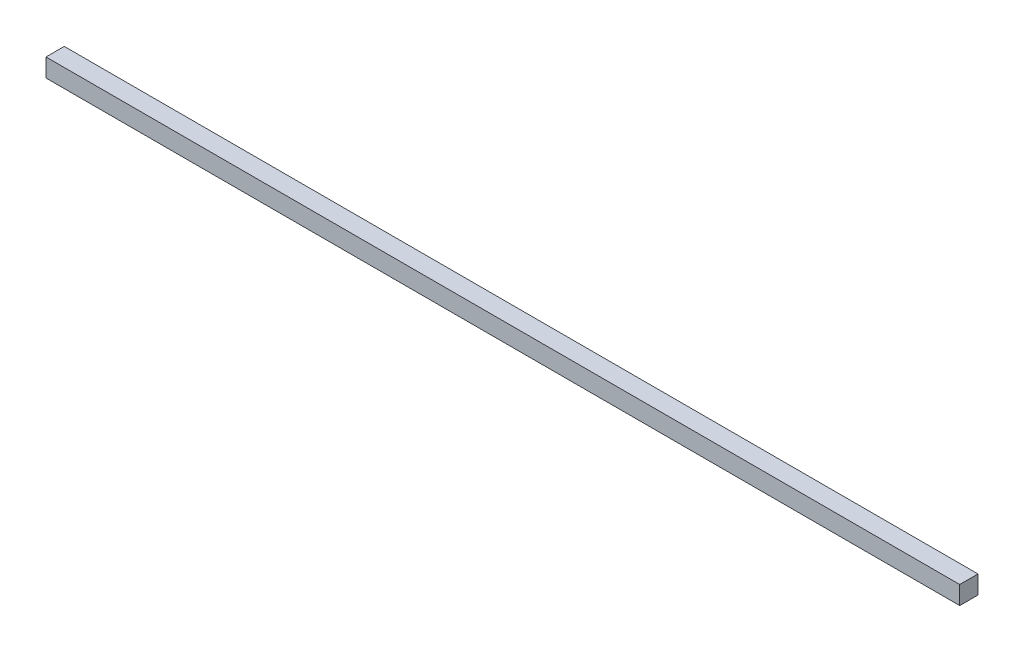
ISO-10303-21;
HEADER;
FILE_DESCRIPTION(('STEP AP214'),'2;1');
FILE_NAME('part.step','',(''),(''),'','','');
FILE_SCHEMA(('AUTOMOTIVE_DESIGN { 1 0 10303 214 1 1 1 1 }'));
ENDSEC;
DATA;
#1=APPLICATION_CONTEXT('core data for automotive mechanical design processes');
#2=APPLICATION_PROTOCOL_DEFINITION('international standard','automotive_design',2000,#1);
#3=PRODUCT_CONTEXT('',#1,'mechanical');
#4=PRODUCT('Part','Part','',(#3));
#5=PRODUCT_RELATED_PRODUCT_CATEGORY('part','',(#4));
#6=PRODUCT_DEFINITION_FORMATION('','',#4);
#7=PRODUCT_DEFINITION_CONTEXT('part definition',#1,'design');
#8=PRODUCT_DEFINITION('design','',#6,#7);
#9=PRODUCT_DEFINITION_SHAPE('','',#8);
#10=(LENGTH_UNIT() NAMED_UNIT(*) SI_UNIT(.MILLI.,.METRE.));
#11=(NAMED_UNIT(*) PLANE_ANGLE_UNIT() SI_UNIT($,.RADIAN.));
#12=(NAMED_UNIT(*) SI_UNIT($,.STERADIAN.) SOLID_ANGLE_UNIT());
#13=UNCERTAINTY_MEASURE_WITH_UNIT(LENGTH_MEASURE(1.E-05),#10,'distance_accuracy_value','');
#14=(GEOMETRIC_REPRESENTATION_CONTEXT(3) GLOBAL_UNCERTAINTY_ASSIGNED_CONTEXT((#13)) GLOBAL_UNIT_ASSIGNED_CONTEXT((#10,
#11,#12)) REPRESENTATION_CONTEXT('',''));
#15=CARTESIAN_POINT('',(0.,0.,0.));
#16=DIRECTION('',(0.,0.,1.));
#17=DIRECTION('',(1.,0.,0.));
#18=AXIS2_PLACEMENT_3D('',#15,#16,#17);
#19=CARTESIAN_POINT('',(500.,5.,5.));
#20=DIRECTION('',(0.,-1.,0.));
#21=DIRECTION('',(0.,0.,-1.));
#22=AXIS2_PLACEMENT_3D('',#19,#20,#21);
#23=PLANE('',#22);
#24=DIRECTION('',(0.,0.,1.));
#25=VECTOR('',#24,1.);
#26=CARTESIAN_POINT('',(0.,5.,5.));
#27=LINE('',#26,#25);
#28=CARTESIAN_POINT('',(0.,5.,-5.));
#29=VERTEX_POINT('',#28);
#30=CARTESIAN_POINT('',(0.,5.,5.));
#31=VERTEX_POINT('',#30);
#32=EDGE_CURVE('E106',#29,#31,#27,.T.);
#33=ORIENTED_EDGE('',*,*,#32,.T.);
#34=DIRECTION('',(-1.,0.,0.));
#35=VECTOR('',#34,1.);
#36=CARTESIAN_POINT('',(500.,5.,5.));
#37=LINE('',#36,#35);
#38=CARTESIAN_POINT('',(500.,5.,5.));
#39=VERTEX_POINT('',#38);
#40=EDGE_CURVE('E11',#39,#31,#37,.T.);
#41=ORIENTED_EDGE('',*,*,#40,.F.);
#42=DIRECTION('',(0.,0.,1.));
#43=VECTOR('',#42,1.);
#44=CARTESIAN_POINT('',(500.,5.,5.));
#45=LINE('',#44,#43);
#46=CARTESIAN_POINT('',(500.,5.,-5.));
#47=VERTEX_POINT('',#46);
#48=EDGE_CURVE('E94',#47,#39,#45,.T.);
#49=ORIENTED_EDGE('',*,*,#48,.F.);
#50=DIRECTION('',(-1.,0.,0.));
#51=VECTOR('',#50,1.);
#52=CARTESIAN_POINT('',(500.,5.,-5.));
#53=LINE('',#52,#51);
#54=EDGE_CURVE('E105',#47,#29,#53,.T.);
#55=ORIENTED_EDGE('',*,*,#54,.T.);
#56=EDGE_LOOP('',(#33,#41,#49,#55));
#57=FACE_BOUND('',#56,.T.);
#58=ADVANCED_FACE('F43',(#57),#23,.F.);
#59=CARTESIAN_POINT('',(500.,-5.,5.));
#60=DIRECTION('',(0.,0.,-1.));
#61=DIRECTION('',(-1.,0.,0.));
#62=AXIS2_PLACEMENT_3D('',#59,#60,#61);
#63=PLANE('',#62);
#64=DIRECTION('',(0.,-1.,0.));
#65=VECTOR('',#64,1.);
#66=CARTESIAN_POINT('',(0.,-5.,5.));
#67=LINE('',#66,#65);
#68=CARTESIAN_POINT('',(0.,-5.,5.));
#69=VERTEX_POINT('',#68);
#70=EDGE_CURVE('E98',#31,#69,#67,.T.);
#71=ORIENTED_EDGE('',*,*,#70,.T.);
#72=DIRECTION('',(-1.,0.,0.));
#73=VECTOR('',#72,1.);
#74=CARTESIAN_POINT('',(500.,-5.,5.));
#75=LINE('',#74,#73);
#76=CARTESIAN_POINT('',(500.,-5.,5.));
#77=VERTEX_POINT('',#76);
#78=EDGE_CURVE('E51',#77,#69,#75,.T.);
#79=ORIENTED_EDGE('',*,*,#78,.F.);
#80=DIRECTION('',(0.,-1.,0.));
#81=VECTOR('',#80,1.);
#82=CARTESIAN_POINT('',(500.,-5.,5.));
#83=LINE('',#82,#81);
#84=EDGE_CURVE('E90',#39,#77,#83,.T.);
#85=ORIENTED_EDGE('',*,*,#84,.F.);
#86=ORIENTED_EDGE('',*,*,#40,.T.);
#87=EDGE_LOOP('',(#71,#79,#85,#86));
#88=FACE_BOUND('',#87,.T.);
#89=ADVANCED_FACE('F100',(#88),#63,.F.);
#90=CARTESIAN_POINT('',(500.,-5.,5.));
#91=DIRECTION('',(0.,1.,0.));
#92=DIRECTION('',(0.,0.,1.));
#93=AXIS2_PLACEMENT_3D('',#90,#91,#92);
#94=PLANE('',#93);
#95=DIRECTION('',(0.,0.,-1.));
#96=VECTOR('',#95,1.);
#97=CARTESIAN_POINT('',(0.,-5.,5.));
#98=LINE('',#97,#96);
#99=CARTESIAN_POINT('',(0.,-5.,-5.));
#100=VERTEX_POINT('',#99);
#101=EDGE_CURVE('E77',#69,#100,#98,.T.);
#102=ORIENTED_EDGE('',*,*,#101,.T.);
#103=DIRECTION('',(-1.,0.,0.));
#104=VECTOR('',#103,1.);
#105=CARTESIAN_POINT('',(500.,-5.,-5.));
#106=LINE('',#105,#104);
#107=CARTESIAN_POINT('',(500.,-5.,-5.));
#108=VERTEX_POINT('',#107);
#109=EDGE_CURVE('E97',#108,#100,#106,.T.);
#110=ORIENTED_EDGE('',*,*,#109,.F.);
#111=DIRECTION('',(0.,0.,-1.));
#112=VECTOR('',#111,1.);
#113=CARTESIAN_POINT('',(500.,-5.,5.));
#114=LINE('',#113,#112);
#115=EDGE_CURVE('E95',#77,#108,#114,.T.);
#116=ORIENTED_EDGE('',*,*,#115,.F.);
#117=ORIENTED_EDGE('',*,*,#78,.T.);
#118=EDGE_LOOP('',(#102,#110,#116,#117));
#119=FACE_BOUND('',#118,.T.);
#120=ADVANCED_FACE('F99',(#119),#94,.F.);
#121=CARTESIAN_POINT('',(500.,-5.,-5.));
#122=DIRECTION('',(0.,0.,1.));
#123=DIRECTION('',(1.,0.,0.));
#124=AXIS2_PLACEMENT_3D('',#121,#122,#123);
#125=PLANE('',#124);
#126=DIRECTION('',(0.,1.,0.));
#127=VECTOR('',#126,1.);
#128=CARTESIAN_POINT('',(0.,-5.,-5.));
#129=LINE('',#128,#127);
#130=EDGE_CURVE('E85',#100,#29,#129,.T.);
#131=ORIENTED_EDGE('',*,*,#130,.T.);
#132=ORIENTED_EDGE('',*,*,#54,.F.);
#133=DIRECTION('',(0.,1.,0.));
#134=VECTOR('',#133,1.);
#135=CARTESIAN_POINT('',(500.,-5.,-5.));
#136=LINE('',#135,#134);
#137=EDGE_CURVE('E56',#108,#47,#136,.T.);
#138=ORIENTED_EDGE('',*,*,#137,.F.);
#139=ORIENTED_EDGE('',*,*,#109,.T.);
#140=EDGE_LOOP('',(#131,#132,#138,#139));
#141=FACE_BOUND('',#140,.T.);
#142=ADVANCED_FACE('F114',(#141),#125,.F.);
#143=CARTESIAN_POINT('',(500.,0.,0.));
#144=DIRECTION('',(1.,0.,0.));
#145=DIRECTION('',(0.,0.,-1.));
#146=AXIS2_PLACEMENT_3D('',#143,#144,#145);
#147=PLANE('',#146);
#148=ORIENTED_EDGE('',*,*,#48,.T.);
#149=ORIENTED_EDGE('',*,*,#84,.T.);
#150=ORIENTED_EDGE('',*,*,#115,.T.);
#151=ORIENTED_EDGE('',*,*,#137,.T.);
#152=EDGE_LOOP('',(#148,#149,#150,#151));
#153=FACE_BOUND('',#152,.T.);
#154=ADVANCED_FACE('F89',(#153),#147,.T.);
#155=CARTESIAN_POINT('',(0.,0.,0.));
#156=DIRECTION('',(1.,0.,0.));
#157=DIRECTION('',(0.,0.,-1.));
#158=AXIS2_PLACEMENT_3D('',#155,#156,#157);
#159=PLANE('',#158);
#160=ORIENTED_EDGE('',*,*,#32,.F.);
#161=ORIENTED_EDGE('',*,*,#130,.F.);
#162=ORIENTED_EDGE('',*,*,#101,.F.);
#163=ORIENTED_EDGE('',*,*,#70,.F.);
#164=EDGE_LOOP('',(#160,#161,#162,#163));
#165=FACE_BOUND('',#164,.T.);
#166=ADVANCED_FACE('F117',(#165),#159,.F.);
#167=CLOSED_SHELL('',(#58,#89,#120,#142,#154,#166));
#168=MANIFOLD_SOLID_BREP('B2',#167);
#169=ADVANCED_BREP_SHAPE_REPRESENTATION('',(#18,#168),#14);
#170=SHAPE_DEFINITION_REPRESENTATION(#9,#169);
ENDSEC;
END-ISO-10303-21;
